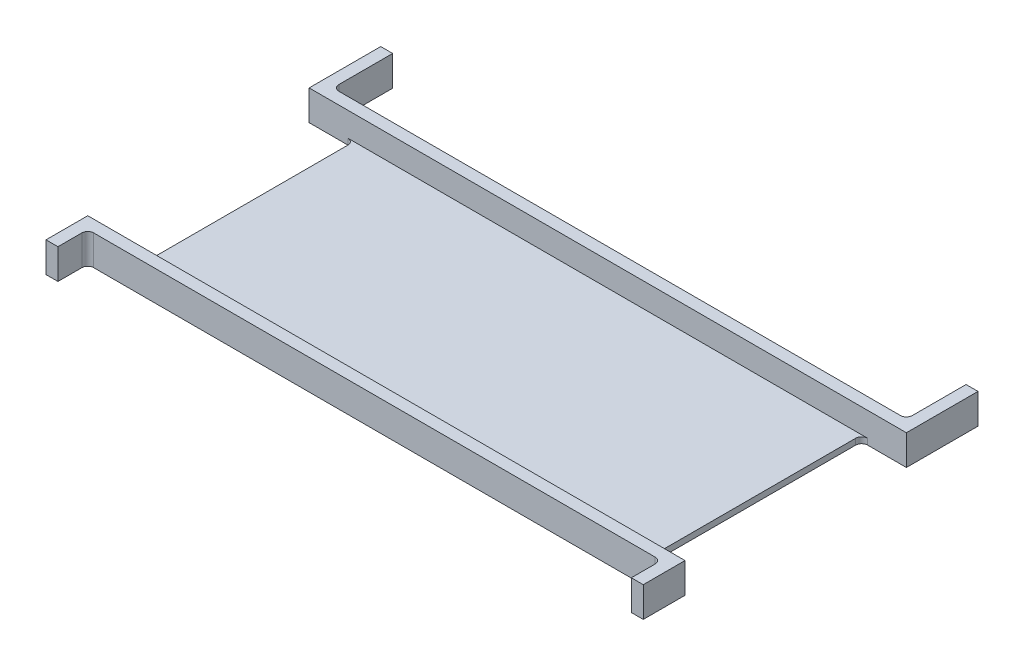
ISO-10303-21;
HEADER;
FILE_DESCRIPTION(('STEP AP214'),'2;1');
FILE_NAME('part.step','',(''),(''),'','','');
FILE_SCHEMA(('AUTOMOTIVE_DESIGN { 1 0 10303 214 1 1 1 1 }'));
ENDSEC;
DATA;
#1=APPLICATION_CONTEXT('core data for automotive mechanical design processes');
#2=APPLICATION_PROTOCOL_DEFINITION('international standard','automotive_design',2000,#1);
#3=PRODUCT_CONTEXT('',#1,'mechanical');
#4=PRODUCT('Part','Part','',(#3));
#5=PRODUCT_RELATED_PRODUCT_CATEGORY('part','',(#4));
#6=PRODUCT_DEFINITION_FORMATION('','',#4);
#7=PRODUCT_DEFINITION_CONTEXT('part definition',#1,'design');
#8=PRODUCT_DEFINITION('design','',#6,#7);
#9=PRODUCT_DEFINITION_SHAPE('','',#8);
#10=(LENGTH_UNIT() NAMED_UNIT(*) SI_UNIT(.MILLI.,.METRE.));
#11=(NAMED_UNIT(*) PLANE_ANGLE_UNIT() SI_UNIT($,.RADIAN.));
#12=(NAMED_UNIT(*) SI_UNIT($,.STERADIAN.) SOLID_ANGLE_UNIT());
#13=UNCERTAINTY_MEASURE_WITH_UNIT(LENGTH_MEASURE(1.E-05),#10,'distance_accuracy_value','');
#14=(GEOMETRIC_REPRESENTATION_CONTEXT(3) GLOBAL_UNCERTAINTY_ASSIGNED_CONTEXT((#13)) GLOBAL_UNIT_ASSIGNED_CONTEXT((#10,
#11,#12)) REPRESENTATION_CONTEXT('',''));
#15=CARTESIAN_POINT('',(0.,0.,0.));
#16=DIRECTION('',(0.,0.,1.));
#17=DIRECTION('',(1.,0.,0.));
#18=AXIS2_PLACEMENT_3D('',#15,#16,#17);
#19=CARTESIAN_POINT('',(92.6,1.,0.));
#20=DIRECTION('',(-1.,0.,0.));
#21=DIRECTION('',(0.,0.,1.));
#22=AXIS2_PLACEMENT_3D('',#19,#20,#21);
#23=PLANE('',#22);
#24=DIRECTION('',(0.,0.,-1.));
#25=VECTOR('',#24,1.);
#26=CARTESIAN_POINT('',(92.6,0.,0.));
#27=LINE('',#26,#25);
#28=CARTESIAN_POINT('',(92.6,0.,-8.00000000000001));
#29=VERTEX_POINT('',#28);
#30=CARTESIAN_POINT('',(92.6,0.,-43.1));
#31=VERTEX_POINT('',#30);
#32=EDGE_CURVE('E389',#29,#31,#27,.T.);
#33=ORIENTED_EDGE('',*,*,#32,.T.);
#34=DIRECTION('',(0.,-1.,0.));
#35=VECTOR('',#34,1.);
#36=CARTESIAN_POINT('',(92.6,1.,-43.1));
#37=LINE('',#36,#35);
#38=CARTESIAN_POINT('',(92.6,1.,-43.1));
#39=VERTEX_POINT('',#38);
#40=EDGE_CURVE('E11',#39,#31,#37,.T.);
#41=ORIENTED_EDGE('',*,*,#40,.F.);
#42=DIRECTION('',(0.,0.,-1.));
#43=VECTOR('',#42,1.);
#44=CARTESIAN_POINT('',(92.6,1.,0.));
#45=LINE('',#44,#43);
#46=CARTESIAN_POINT('',(92.6,1.,-8.00000000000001));
#47=VERTEX_POINT('',#46);
#48=EDGE_CURVE('E390',#47,#39,#45,.T.);
#49=ORIENTED_EDGE('',*,*,#48,.F.);
#50=DIRECTION('',(0.,-1.,0.));
#51=VECTOR('',#50,1.);
#52=CARTESIAN_POINT('',(92.6,1.,-8.00000000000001));
#53=LINE('',#52,#51);
#54=EDGE_CURVE('E53',#47,#29,#53,.T.);
#55=ORIENTED_EDGE('',*,*,#54,.T.);
#56=EDGE_LOOP('',(#33,#41,#49,#55));
#57=FACE_BOUND('',#56,.T.);
#58=ADVANCED_FACE('F37',(#57),#23,.F.);
#59=CARTESIAN_POINT('',(93.6,1.,-43.1));
#60=DIRECTION('',(0.,-1.,0.));
#61=DIRECTION('',(0.,0.,-1.));
#62=AXIS2_PLACEMENT_3D('',#59,#60,#61);
#63=CYLINDRICAL_SURFACE('',#62,1.);
#64=CARTESIAN_POINT('',(93.6,0.,-43.1));
#65=DIRECTION('',(0.,1.,0.));
#66=DIRECTION('',(0.,0.,1.));
#67=AXIS2_PLACEMENT_3D('',#64,#65,#66);
#68=CIRCLE('',#67,1.);
#69=CARTESIAN_POINT('',(93.6,0.,-44.1));
#70=VERTEX_POINT('',#69);
#71=EDGE_CURVE('E409',#31,#70,#68,.F.);
#72=ORIENTED_EDGE('',*,*,#71,.T.);
#73=DIRECTION('',(0.,-1.,0.));
#74=VECTOR('',#73,1.);
#75=CARTESIAN_POINT('',(93.6,1.,-44.1));
#76=LINE('',#75,#74);
#77=CARTESIAN_POINT('',(93.6,1.,-44.1));
#78=VERTEX_POINT('',#77);
#79=EDGE_CURVE('E45',#78,#70,#76,.T.);
#80=ORIENTED_EDGE('',*,*,#79,.F.);
#81=CARTESIAN_POINT('',(93.6,1.,-43.1));
#82=DIRECTION('',(0.,1.,0.));
#83=DIRECTION('',(0.,0.,1.));
#84=AXIS2_PLACEMENT_3D('',#81,#82,#83);
#85=CIRCLE('',#84,1.);
#86=EDGE_CURVE('E89',#39,#78,#85,.F.);
#87=ORIENTED_EDGE('',*,*,#86,.F.);
#88=ORIENTED_EDGE('',*,*,#40,.T.);
#89=EDGE_LOOP('',(#72,#80,#87,#88));
#90=FACE_BOUND('',#89,.T.);
#91=ADVANCED_FACE('F440',(#90),#63,.F.);
#92=CARTESIAN_POINT('',(6.5,1.,-43.1));
#93=DIRECTION('',(0.,-1.,0.));
#94=DIRECTION('',(0.,0.,-1.));
#95=AXIS2_PLACEMENT_3D('',#92,#93,#94);
#96=CYLINDRICAL_SURFACE('',#95,1.);
#97=CARTESIAN_POINT('',(6.5,0.,-43.1));
#98=DIRECTION('',(0.,1.,0.));
#99=DIRECTION('',(0.,0.,1.));
#100=AXIS2_PLACEMENT_3D('',#97,#98,#99);
#101=CIRCLE('',#100,1.);
#102=CARTESIAN_POINT('',(7.5,0.,-43.1));
#103=VERTEX_POINT('',#102);
#104=CARTESIAN_POINT('',(6.49999999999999,0.,-44.1));
#105=VERTEX_POINT('',#104);
#106=EDGE_CURVE('E412',#103,#105,#101,.T.);
#107=ORIENTED_EDGE('',*,*,#106,.F.);
#108=DIRECTION('',(0.,-1.,0.));
#109=VECTOR('',#108,1.);
#110=CARTESIAN_POINT('',(7.5,1.,-43.1));
#111=LINE('',#110,#109);
#112=CARTESIAN_POINT('',(7.5,1.,-43.1));
#113=VERTEX_POINT('',#112);
#114=EDGE_CURVE('E431',#113,#103,#111,.T.);
#115=ORIENTED_EDGE('',*,*,#114,.F.);
#116=CARTESIAN_POINT('',(6.5,1.,-43.1));
#117=DIRECTION('',(0.,1.,0.));
#118=DIRECTION('',(0.,0.,1.));
#119=AXIS2_PLACEMENT_3D('',#116,#117,#118);
#120=CIRCLE('',#119,1.);
#121=CARTESIAN_POINT('',(6.49999999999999,1.,-44.1));
#122=VERTEX_POINT('',#121);
#123=EDGE_CURVE('E396',#113,#122,#120,.T.);
#124=ORIENTED_EDGE('',*,*,#123,.T.);
#125=DIRECTION('',(0.,-1.,0.));
#126=VECTOR('',#125,1.);
#127=CARTESIAN_POINT('',(6.5,1.,-44.1));
#128=LINE('',#127,#126);
#129=EDGE_CURVE('E433',#122,#105,#128,.T.);
#130=ORIENTED_EDGE('',*,*,#129,.T.);
#131=EDGE_LOOP('',(#107,#115,#124,#130));
#132=FACE_BOUND('',#131,.T.);
#133=ADVANCED_FACE('F468',(#132),#96,.F.);
#134=CARTESIAN_POINT('',(7.5,1.,0.));
#135=DIRECTION('',(1.,0.,0.));
#136=DIRECTION('',(0.,0.,-1.));
#137=AXIS2_PLACEMENT_3D('',#134,#135,#136);
#138=PLANE('',#137);
#139=DIRECTION('',(0.,0.,1.));
#140=VECTOR('',#139,1.);
#141=CARTESIAN_POINT('',(7.5,0.,0.));
#142=LINE('',#141,#140);
#143=CARTESIAN_POINT('',(7.5,0.,-8.00000000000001));
#144=VERTEX_POINT('',#143);
#145=EDGE_CURVE('E415',#103,#144,#142,.T.);
#146=ORIENTED_EDGE('',*,*,#145,.T.);
#147=DIRECTION('',(0.,-1.,0.));
#148=VECTOR('',#147,1.);
#149=CARTESIAN_POINT('',(7.5,1.,-8.00000000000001));
#150=LINE('',#149,#148);
#151=CARTESIAN_POINT('',(7.5,1.,-8.00000000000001));
#152=VERTEX_POINT('',#151);
#153=EDGE_CURVE('E428',#152,#144,#150,.T.);
#154=ORIENTED_EDGE('',*,*,#153,.F.);
#155=DIRECTION('',(0.,0.,1.));
#156=VECTOR('',#155,1.);
#157=CARTESIAN_POINT('',(7.5,1.,0.));
#158=LINE('',#157,#156);
#159=EDGE_CURVE('E399',#113,#152,#158,.T.);
#160=ORIENTED_EDGE('',*,*,#159,.F.);
#161=ORIENTED_EDGE('',*,*,#114,.T.);
#162=EDGE_LOOP('',(#146,#154,#160,#161));
#163=FACE_BOUND('',#162,.T.);
#164=ADVANCED_FACE('F482',(#163),#138,.F.);
#165=CARTESIAN_POINT('',(6.5,1.,-8.));
#166=DIRECTION('',(0.,-1.,0.));
#167=DIRECTION('',(0.,0.,-1.));
#168=AXIS2_PLACEMENT_3D('',#165,#166,#167);
#169=CYLINDRICAL_SURFACE('',#168,1.);
#170=CARTESIAN_POINT('',(6.5,0.,-8.));
#171=DIRECTION('',(0.,1.,0.));
#172=DIRECTION('',(0.,0.,1.));
#173=AXIS2_PLACEMENT_3D('',#170,#171,#172);
#174=CIRCLE('',#173,1.);
#175=CARTESIAN_POINT('',(6.49999999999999,0.,-7.));
#176=VERTEX_POINT('',#175);
#177=EDGE_CURVE('E417',#144,#176,#174,.F.);
#178=ORIENTED_EDGE('',*,*,#177,.T.);
#179=DIRECTION('',(0.,-1.,0.));
#180=VECTOR('',#179,1.);
#181=CARTESIAN_POINT('',(6.49999999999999,1.,-7.));
#182=LINE('',#181,#180);
#183=CARTESIAN_POINT('',(6.49999999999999,1.,-7.));
#184=VERTEX_POINT('',#183);
#185=EDGE_CURVE('E426',#184,#176,#182,.T.);
#186=ORIENTED_EDGE('',*,*,#185,.F.);
#187=CARTESIAN_POINT('',(6.5,1.,-8.));
#188=DIRECTION('',(0.,1.,0.));
#189=DIRECTION('',(0.,0.,1.));
#190=AXIS2_PLACEMENT_3D('',#187,#188,#189);
#191=CIRCLE('',#190,1.);
#192=EDGE_CURVE('E401',#152,#184,#191,.F.);
#193=ORIENTED_EDGE('',*,*,#192,.F.);
#194=ORIENTED_EDGE('',*,*,#153,.T.);
#195=EDGE_LOOP('',(#178,#186,#193,#194));
#196=FACE_BOUND('',#195,.T.);
#197=ADVANCED_FACE('F487',(#196),#169,.F.);
#198=CARTESIAN_POINT('',(93.6,1.,-8.));
#199=DIRECTION('',(0.,-1.,0.));
#200=DIRECTION('',(0.,0.,-1.));
#201=AXIS2_PLACEMENT_3D('',#198,#199,#200);
#202=CYLINDRICAL_SURFACE('',#201,1.);
#203=CARTESIAN_POINT('',(93.6,0.,-8.));
#204=DIRECTION('',(0.,1.,0.));
#205=DIRECTION('',(0.,0.,1.));
#206=AXIS2_PLACEMENT_3D('',#203,#204,#205);
#207=CIRCLE('',#206,1.);
#208=CARTESIAN_POINT('',(93.6,0.,-7.));
#209=VERTEX_POINT('',#208);
#210=EDGE_CURVE('E392',#29,#209,#207,.T.);
#211=ORIENTED_EDGE('',*,*,#210,.F.);
#212=ORIENTED_EDGE('',*,*,#54,.F.);
#213=CARTESIAN_POINT('',(93.6,1.,-8.));
#214=DIRECTION('',(0.,1.,0.));
#215=DIRECTION('',(0.,0.,1.));
#216=AXIS2_PLACEMENT_3D('',#213,#214,#215);
#217=CIRCLE('',#216,1.);
#218=CARTESIAN_POINT('',(93.6,1.,-7.));
#219=VERTEX_POINT('',#218);
#220=EDGE_CURVE('E406',#47,#219,#217,.T.);
#221=ORIENTED_EDGE('',*,*,#220,.T.);
#222=DIRECTION('',(0.,-1.,0.));
#223=VECTOR('',#222,1.);
#224=CARTESIAN_POINT('',(93.6,1.,-7.));
#225=LINE('',#224,#223);
#226=EDGE_CURVE('E423',#219,#209,#225,.T.);
#227=ORIENTED_EDGE('',*,*,#226,.T.);
#228=EDGE_LOOP('',(#211,#212,#221,#227));
#229=FACE_BOUND('',#228,.T.);
#230=ADVANCED_FACE('F491',(#229),#202,.F.);
#231=CARTESIAN_POINT('',(0.,1.,0.));
#232=DIRECTION('',(0.,1.,0.));
#233=DIRECTION('',(0.,0.,1.));
#234=AXIS2_PLACEMENT_3D('',#231,#232,#233);
#235=PLANE('',#234);
#236=ORIENTED_EDGE('',*,*,#48,.T.);
#237=ORIENTED_EDGE('',*,*,#86,.T.);
#238=DIRECTION('',(1.,0.,0.));
#239=VECTOR('',#238,1.);
#240=CARTESIAN_POINT('',(0.,1.,-44.1));
#241=LINE('',#240,#239);
#242=EDGE_CURVE('E394',#122,#78,#241,.T.);
#243=ORIENTED_EDGE('',*,*,#242,.F.);
#244=ORIENTED_EDGE('',*,*,#123,.F.);
#245=ORIENTED_EDGE('',*,*,#159,.T.);
#246=ORIENTED_EDGE('',*,*,#192,.T.);
#247=DIRECTION('',(-1.,0.,0.));
#248=VECTOR('',#247,1.);
#249=CARTESIAN_POINT('',(0.,1.,-7.));
#250=LINE('',#249,#248);
#251=EDGE_CURVE('E404',#219,#184,#250,.T.);
#252=ORIENTED_EDGE('',*,*,#251,.F.);
#253=ORIENTED_EDGE('',*,*,#220,.F.);
#254=EDGE_LOOP('',(#236,#237,#243,#244,#245,#246,#252,#253));
#255=FACE_BOUND('',#254,.T.);
#256=ADVANCED_FACE('F472',(#255),#235,.T.);
#257=CARTESIAN_POINT('',(0.,0.,0.));
#258=DIRECTION('',(0.,1.,0.));
#259=DIRECTION('',(0.,0.,1.));
#260=AXIS2_PLACEMENT_3D('',#257,#258,#259);
#261=PLANE('',#260);
#262=ORIENTED_EDGE('',*,*,#32,.F.);
#263=ORIENTED_EDGE('',*,*,#210,.T.);
#264=DIRECTION('',(-1.,0.,0.));
#265=VECTOR('',#264,1.);
#266=CARTESIAN_POINT('',(0.,0.,-7.));
#267=LINE('',#266,#265);
#268=CARTESIAN_POINT('',(100.1,0.,-7.));
#269=VERTEX_POINT('',#268);
#270=EDGE_CURVE('E286',#269,#209,#267,.T.);
#271=ORIENTED_EDGE('',*,*,#270,.F.);
#272=DIRECTION('',(0.,0.,-1.));
#273=VECTOR('',#272,1.);
#274=CARTESIAN_POINT('',(100.1,0.,0.));
#275=LINE('',#274,#273);
#276=CARTESIAN_POINT('',(100.1,0.,0.));
#277=VERTEX_POINT('',#276);
#278=EDGE_CURVE('E284',#277,#269,#275,.T.);
#279=ORIENTED_EDGE('',*,*,#278,.F.);
#280=DIRECTION('',(1.,0.,0.));
#281=VECTOR('',#280,1.);
#282=CARTESIAN_POINT('',(0.,0.,0.));
#283=LINE('',#282,#281);
#284=CARTESIAN_POINT('',(98.1,0.,0.));
#285=VERTEX_POINT('',#284);
#286=EDGE_CURVE('E282',#285,#277,#283,.T.);
#287=ORIENTED_EDGE('',*,*,#286,.F.);
#288=DIRECTION('',(0.,0.,1.));
#289=VECTOR('',#288,1.);
#290=CARTESIAN_POINT('',(98.1,0.,0.));
#291=LINE('',#290,#289);
#292=CARTESIAN_POINT('',(98.1,0.,-3.99999999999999));
#293=VERTEX_POINT('',#292);
#294=EDGE_CURVE('E280',#293,#285,#291,.T.);
#295=ORIENTED_EDGE('',*,*,#294,.F.);
#296=CARTESIAN_POINT('',(97.1,0.,-4.));
#297=DIRECTION('',(0.,1.,0.));
#298=DIRECTION('',(0.,0.,1.));
#299=AXIS2_PLACEMENT_3D('',#296,#297,#298);
#300=CIRCLE('',#299,1.);
#301=CARTESIAN_POINT('',(97.1,0.,-5.));
#302=VERTEX_POINT('',#301);
#303=EDGE_CURVE('E237',#293,#302,#300,.T.);
#304=ORIENTED_EDGE('',*,*,#303,.T.);
#305=DIRECTION('',(1.,0.,0.));
#306=VECTOR('',#305,1.);
#307=CARTESIAN_POINT('',(0.,0.,-5.));
#308=LINE('',#307,#306);
#309=CARTESIAN_POINT('',(3.00000000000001,0.,-5.));
#310=VERTEX_POINT('',#309);
#311=EDGE_CURVE('E256',#310,#302,#308,.T.);
#312=ORIENTED_EDGE('',*,*,#311,.F.);
#313=CARTESIAN_POINT('',(3.,0.,-4.));
#314=DIRECTION('',(0.,1.,0.));
#315=DIRECTION('',(0.,0.,1.));
#316=AXIS2_PLACEMENT_3D('',#313,#314,#315);
#317=CIRCLE('',#316,1.);
#318=CARTESIAN_POINT('',(2.,0.,-3.99999999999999));
#319=VERTEX_POINT('',#318);
#320=EDGE_CURVE('E259',#310,#319,#317,.T.);
#321=ORIENTED_EDGE('',*,*,#320,.T.);
#322=DIRECTION('',(0.,0.,-1.));
#323=VECTOR('',#322,1.);
#324=CARTESIAN_POINT('',(2.,0.,0.));
#325=LINE('',#324,#323);
#326=CARTESIAN_POINT('',(2.,0.,0.));
#327=VERTEX_POINT('',#326);
#328=EDGE_CURVE('E292',#327,#319,#325,.T.);
#329=ORIENTED_EDGE('',*,*,#328,.F.);
#330=DIRECTION('',(1.,0.,0.));
#331=VECTOR('',#330,1.);
#332=CARTESIAN_POINT('',(0.,0.,0.));
#333=LINE('',#332,#331);
#334=CARTESIAN_POINT('',(0.,0.,0.));
#335=VERTEX_POINT('',#334);
#336=EDGE_CURVE('E290',#335,#327,#333,.T.);
#337=ORIENTED_EDGE('',*,*,#336,.F.);
#338=DIRECTION('',(0.,0.,-1.));
#339=VECTOR('',#338,1.);
#340=CARTESIAN_POINT('',(0.,0.,0.));
#341=LINE('',#340,#339);
#342=CARTESIAN_POINT('',(0.,0.,-7.));
#343=VERTEX_POINT('',#342);
#344=EDGE_CURVE('E288',#335,#343,#341,.T.);
#345=ORIENTED_EDGE('',*,*,#344,.T.);
#346=EDGE_CURVE('E78',#176,#343,#267,.T.);
#347=ORIENTED_EDGE('',*,*,#346,.F.);
#348=ORIENTED_EDGE('',*,*,#177,.F.);
#349=ORIENTED_EDGE('',*,*,#145,.F.);
#350=ORIENTED_EDGE('',*,*,#106,.T.);
#351=DIRECTION('',(1.,0.,0.));
#352=VECTOR('',#351,1.);
#353=CARTESIAN_POINT('',(0.,0.,-44.1));
#354=LINE('',#353,#352);
#355=CARTESIAN_POINT('',(0.,0.,-44.1));
#356=VERTEX_POINT('',#355);
#357=EDGE_CURVE('E351',#356,#105,#354,.T.);
#358=ORIENTED_EDGE('',*,*,#357,.F.);
#359=DIRECTION('',(0.,0.,1.));
#360=VECTOR('',#359,1.);
#361=CARTESIAN_POINT('',(0.,0.,0.));
#362=LINE('',#361,#360);
#363=CARTESIAN_POINT('',(0.,0.,-56.1));
#364=VERTEX_POINT('',#363);
#365=EDGE_CURVE('E348',#364,#356,#362,.T.);
#366=ORIENTED_EDGE('',*,*,#365,.F.);
#367=DIRECTION('',(-1.,0.,0.));
#368=VECTOR('',#367,1.);
#369=CARTESIAN_POINT('',(1.94635974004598E-13,0.,-56.1));
#370=LINE('',#369,#368);
#371=CARTESIAN_POINT('',(2.,0.,-56.1));
#372=VERTEX_POINT('',#371);
#373=EDGE_CURVE('E346',#372,#364,#370,.T.);
#374=ORIENTED_EDGE('',*,*,#373,.F.);
#375=DIRECTION('',(0.,0.,-1.));
#376=VECTOR('',#375,1.);
#377=CARTESIAN_POINT('',(2.,0.,0.));
#378=LINE('',#377,#376);
#379=CARTESIAN_POINT('',(2.,0.,-47.1));
#380=VERTEX_POINT('',#379);
#381=EDGE_CURVE('E344',#380,#372,#378,.T.);
#382=ORIENTED_EDGE('',*,*,#381,.F.);
#383=CARTESIAN_POINT('',(3.,0.,-47.1));
#384=DIRECTION('',(0.,1.,0.));
#385=DIRECTION('',(0.,0.,1.));
#386=AXIS2_PLACEMENT_3D('',#383,#384,#385);
#387=CIRCLE('',#386,1.);
#388=CARTESIAN_POINT('',(3.00000000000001,0.,-46.1));
#389=VERTEX_POINT('',#388);
#390=EDGE_CURVE('E342',#389,#380,#387,.F.);
#391=ORIENTED_EDGE('',*,*,#390,.F.);
#392=DIRECTION('',(-1.,0.,0.));
#393=VECTOR('',#392,1.);
#394=CARTESIAN_POINT('',(0.,0.,-46.1));
#395=LINE('',#394,#393);
#396=CARTESIAN_POINT('',(97.1,0.,-46.1));
#397=VERTEX_POINT('',#396);
#398=EDGE_CURVE('E240',#397,#389,#395,.T.);
#399=ORIENTED_EDGE('',*,*,#398,.F.);
#400=CARTESIAN_POINT('',(97.1,0.,-47.1));
#401=DIRECTION('',(0.,1.,0.));
#402=DIRECTION('',(0.,0.,1.));
#403=AXIS2_PLACEMENT_3D('',#400,#401,#402);
#404=CIRCLE('',#403,1.);
#405=CARTESIAN_POINT('',(98.1,0.,-47.1));
#406=VERTEX_POINT('',#405);
#407=EDGE_CURVE('E321',#406,#397,#404,.F.);
#408=ORIENTED_EDGE('',*,*,#407,.F.);
#409=DIRECTION('',(0.,0.,1.));
#410=VECTOR('',#409,1.);
#411=CARTESIAN_POINT('',(98.1000000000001,0.,-1.51267887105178E-13));
#412=LINE('',#411,#410);
#413=CARTESIAN_POINT('',(98.1,0.,-56.1));
#414=VERTEX_POINT('',#413);
#415=EDGE_CURVE('E357',#414,#406,#412,.T.);
#416=ORIENTED_EDGE('',*,*,#415,.F.);
#417=DIRECTION('',(-1.,0.,0.));
#418=VECTOR('',#417,1.);
#419=CARTESIAN_POINT('',(0.,0.,-56.1));
#420=LINE('',#419,#418);
#421=CARTESIAN_POINT('',(100.1,0.,-56.1));
#422=VERTEX_POINT('',#421);
#423=EDGE_CURVE('E355',#422,#414,#420,.T.);
#424=ORIENTED_EDGE('',*,*,#423,.F.);
#425=DIRECTION('',(0.,0.,-1.));
#426=VECTOR('',#425,1.);
#427=CARTESIAN_POINT('',(100.1,0.,0.));
#428=LINE('',#427,#426);
#429=CARTESIAN_POINT('',(100.1,0.,-44.1));
#430=VERTEX_POINT('',#429);
#431=EDGE_CURVE('E353',#430,#422,#428,.T.);
#432=ORIENTED_EDGE('',*,*,#431,.F.);
#433=EDGE_CURVE('E350',#70,#430,#354,.T.);
#434=ORIENTED_EDGE('',*,*,#433,.F.);
#435=ORIENTED_EDGE('',*,*,#71,.F.);
#436=EDGE_LOOP('',(#262,#263,#271,#279,#287,#295,#304,#312,#321,#329,#337,#345,#347,#348,#349,
#350,#358,#366,#374,#382,#391,#399,#408,#416,#424,#432,#434,#435));
#437=FACE_BOUND('',#436,.T.);
#438=ADVANCED_FACE('F442',(#437),#261,.F.);
#439=CARTESIAN_POINT('',(0.,5.05,-46.1));
#440=DIRECTION('',(0.,0.,1.));
#441=DIRECTION('',(1.,0.,0.));
#442=AXIS2_PLACEMENT_3D('',#439,#440,#441);
#443=PLANE('',#442);
#444=ORIENTED_EDGE('',*,*,#398,.T.);
#445=DIRECTION('',(0.,-1.,0.));
#446=VECTOR('',#445,1.);
#447=CARTESIAN_POINT('',(3.00000000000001,5.05,-46.1));
#448=LINE('',#447,#446);
#449=CARTESIAN_POINT('',(3.00000000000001,5.05,-46.1));
#450=VERTEX_POINT('',#449);
#451=EDGE_CURVE('E386',#450,#389,#448,.T.);
#452=ORIENTED_EDGE('',*,*,#451,.F.);
#453=DIRECTION('',(-1.,0.,0.));
#454=VECTOR('',#453,1.);
#455=CARTESIAN_POINT('',(0.,5.05,-46.1));
#456=LINE('',#455,#454);
#457=CARTESIAN_POINT('',(97.1,5.05,-46.1));
#458=VERTEX_POINT('',#457);
#459=EDGE_CURVE('E317',#458,#450,#456,.T.);
#460=ORIENTED_EDGE('',*,*,#459,.F.);
#461=DIRECTION('',(0.,-1.,0.));
#462=VECTOR('',#461,1.);
#463=CARTESIAN_POINT('',(97.1,5.05,-46.1));
#464=LINE('',#463,#462);
#465=EDGE_CURVE('E339',#458,#397,#464,.T.);
#466=ORIENTED_EDGE('',*,*,#465,.T.);
#467=EDGE_LOOP('',(#444,#452,#460,#466));
#468=FACE_BOUND('',#467,.T.);
#469=ADVANCED_FACE('F497',(#468),#443,.F.);
#470=CARTESIAN_POINT('',(3.,5.05,-47.1));
#471=DIRECTION('',(0.,-1.,0.));
#472=DIRECTION('',(0.,0.,-1.));
#473=AXIS2_PLACEMENT_3D('',#470,#471,#472);
#474=CYLINDRICAL_SURFACE('',#473,1.);
#475=ORIENTED_EDGE('',*,*,#390,.T.);
#476=DIRECTION('',(0.,-1.,0.));
#477=VECTOR('',#476,1.);
#478=CARTESIAN_POINT('',(2.,5.05,-47.1));
#479=LINE('',#478,#477);
#480=CARTESIAN_POINT('',(2.,5.05,-47.1));
#481=VERTEX_POINT('',#480);
#482=EDGE_CURVE('E383',#481,#380,#479,.T.);
#483=ORIENTED_EDGE('',*,*,#482,.F.);
#484=CARTESIAN_POINT('',(3.,5.05,-47.1));
#485=DIRECTION('',(0.,1.,0.));
#486=DIRECTION('',(0.,0.,1.));
#487=AXIS2_PLACEMENT_3D('',#484,#485,#486);
#488=CIRCLE('',#487,1.);
#489=EDGE_CURVE('E320',#450,#481,#488,.F.);
#490=ORIENTED_EDGE('',*,*,#489,.F.);
#491=ORIENTED_EDGE('',*,*,#451,.T.);
#492=EDGE_LOOP('',(#475,#483,#490,#491));
#493=FACE_BOUND('',#492,.T.);
#494=ADVANCED_FACE('F502',(#493),#474,.F.);
#495=CARTESIAN_POINT('',(2.,5.05,0.));
#496=DIRECTION('',(-1.,0.,0.));
#497=DIRECTION('',(0.,0.,1.));
#498=AXIS2_PLACEMENT_3D('',#495,#496,#497);
#499=PLANE('',#498);
#500=ORIENTED_EDGE('',*,*,#381,.T.);
#501=DIRECTION('',(0.,-1.,0.));
#502=VECTOR('',#501,1.);
#503=CARTESIAN_POINT('',(2.,5.05,-56.1));
#504=LINE('',#503,#502);
#505=CARTESIAN_POINT('',(2.,5.05,-56.1));
#506=VERTEX_POINT('',#505);
#507=EDGE_CURVE('E380',#506,#372,#504,.T.);
#508=ORIENTED_EDGE('',*,*,#507,.F.);
#509=DIRECTION('',(0.,0.,-1.));
#510=VECTOR('',#509,1.);
#511=CARTESIAN_POINT('',(2.,5.05,0.));
#512=LINE('',#511,#510);
#513=EDGE_CURVE('E323',#481,#506,#512,.T.);
#514=ORIENTED_EDGE('',*,*,#513,.F.);
#515=ORIENTED_EDGE('',*,*,#482,.T.);
#516=EDGE_LOOP('',(#500,#508,#514,#515));
#517=FACE_BOUND('',#516,.T.);
#518=ADVANCED_FACE('F506',(#517),#499,.F.);
#519=CARTESIAN_POINT('',(1.94635974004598E-13,5.05,-56.1));
#520=DIRECTION('',(0.,0.,1.));
#521=DIRECTION('',(1.,0.,0.));
#522=AXIS2_PLACEMENT_3D('',#519,#520,#521);
#523=PLANE('',#522);
#524=ORIENTED_EDGE('',*,*,#373,.T.);
#525=DIRECTION('',(0.,-1.,0.));
#526=VECTOR('',#525,1.);
#527=CARTESIAN_POINT('',(0.,5.05,-56.1));
#528=LINE('',#527,#526);
#529=CARTESIAN_POINT('',(0.,5.05,-56.1));
#530=VERTEX_POINT('',#529);
#531=EDGE_CURVE('E377',#530,#364,#528,.T.);
#532=ORIENTED_EDGE('',*,*,#531,.F.);
#533=DIRECTION('',(-1.,0.,0.));
#534=VECTOR('',#533,1.);
#535=CARTESIAN_POINT('',(1.94635974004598E-13,5.05,-56.1));
#536=LINE('',#535,#534);
#537=EDGE_CURVE('E325',#506,#530,#536,.T.);
#538=ORIENTED_EDGE('',*,*,#537,.F.);
#539=ORIENTED_EDGE('',*,*,#507,.T.);
#540=EDGE_LOOP('',(#524,#532,#538,#539));
#541=FACE_BOUND('',#540,.T.);
#542=ADVANCED_FACE('F510',(#541),#523,.F.);
#543=CARTESIAN_POINT('',(0.,5.05,0.));
#544=DIRECTION('',(1.,0.,0.));
#545=DIRECTION('',(0.,0.,-1.));
#546=AXIS2_PLACEMENT_3D('',#543,#544,#545);
#547=PLANE('',#546);
#548=ORIENTED_EDGE('',*,*,#365,.T.);
#549=DIRECTION('',(0.,-1.,0.));
#550=VECTOR('',#549,1.);
#551=CARTESIAN_POINT('',(0.,5.05,-44.1));
#552=LINE('',#551,#550);
#553=CARTESIAN_POINT('',(0.,5.05,-44.1));
#554=VERTEX_POINT('',#553);
#555=EDGE_CURVE('E374',#554,#356,#552,.T.);
#556=ORIENTED_EDGE('',*,*,#555,.F.);
#557=DIRECTION('',(0.,0.,1.));
#558=VECTOR('',#557,1.);
#559=CARTESIAN_POINT('',(0.,5.05,0.));
#560=LINE('',#559,#558);
#561=EDGE_CURVE('E327',#530,#554,#560,.T.);
#562=ORIENTED_EDGE('',*,*,#561,.F.);
#563=ORIENTED_EDGE('',*,*,#531,.T.);
#564=EDGE_LOOP('',(#548,#556,#562,#563));
#565=FACE_BOUND('',#564,.T.);
#566=ADVANCED_FACE('F514',(#565),#547,.F.);
#567=CARTESIAN_POINT('',(0.,5.05,-44.1));
#568=DIRECTION('',(0.,0.,-1.));
#569=DIRECTION('',(-1.,0.,0.));
#570=AXIS2_PLACEMENT_3D('',#567,#568,#569);
#571=PLANE('',#570);
#572=ORIENTED_EDGE('',*,*,#79,.T.);
#573=ORIENTED_EDGE('',*,*,#433,.T.);
#574=DIRECTION('',(0.,-1.,0.));
#575=VECTOR('',#574,1.);
#576=CARTESIAN_POINT('',(100.1,5.05,-44.1));
#577=LINE('',#576,#575);
#578=CARTESIAN_POINT('',(100.1,5.05,-44.1));
#579=VERTEX_POINT('',#578);
#580=EDGE_CURVE('E371',#579,#430,#577,.T.);
#581=ORIENTED_EDGE('',*,*,#580,.F.);
#582=DIRECTION('',(1.,0.,0.));
#583=VECTOR('',#582,1.);
#584=CARTESIAN_POINT('',(0.,5.05,-44.1));
#585=LINE('',#584,#583);
#586=EDGE_CURVE('E329',#554,#579,#585,.T.);
#587=ORIENTED_EDGE('',*,*,#586,.F.);
#588=ORIENTED_EDGE('',*,*,#555,.T.);
#589=ORIENTED_EDGE('',*,*,#357,.T.);
#590=ORIENTED_EDGE('',*,*,#129,.F.);
#591=ORIENTED_EDGE('',*,*,#242,.T.);
#592=EDGE_LOOP('',(#572,#573,#581,#587,#588,#589,#590,#591));
#593=FACE_BOUND('',#592,.T.);
#594=ADVANCED_FACE('F437',(#593),#571,.F.);
#595=CARTESIAN_POINT('',(100.1,5.05,0.));
#596=DIRECTION('',(-1.,0.,0.));
#597=DIRECTION('',(0.,0.,1.));
#598=AXIS2_PLACEMENT_3D('',#595,#596,#597);
#599=PLANE('',#598);
#600=ORIENTED_EDGE('',*,*,#431,.T.);
#601=DIRECTION('',(0.,-1.,0.));
#602=VECTOR('',#601,1.);
#603=CARTESIAN_POINT('',(100.1,5.05,-56.1));
#604=LINE('',#603,#602);
#605=CARTESIAN_POINT('',(100.1,5.05,-56.1));
#606=VERTEX_POINT('',#605);
#607=EDGE_CURVE('E368',#606,#422,#604,.T.);
#608=ORIENTED_EDGE('',*,*,#607,.F.);
#609=DIRECTION('',(0.,0.,-1.));
#610=VECTOR('',#609,1.);
#611=CARTESIAN_POINT('',(100.1,5.05,0.));
#612=LINE('',#611,#610);
#613=EDGE_CURVE('E331',#579,#606,#612,.T.);
#614=ORIENTED_EDGE('',*,*,#613,.F.);
#615=ORIENTED_EDGE('',*,*,#580,.T.);
#616=EDGE_LOOP('',(#600,#608,#614,#615));
#617=FACE_BOUND('',#616,.T.);
#618=ADVANCED_FACE('F448',(#617),#599,.F.);
#619=CARTESIAN_POINT('',(0.,5.05,-56.1));
#620=DIRECTION('',(0.,0.,1.));
#621=DIRECTION('',(1.,0.,0.));
#622=AXIS2_PLACEMENT_3D('',#619,#620,#621);
#623=PLANE('',#622);
#624=ORIENTED_EDGE('',*,*,#423,.T.);
#625=DIRECTION('',(0.,-1.,0.));
#626=VECTOR('',#625,1.);
#627=CARTESIAN_POINT('',(98.1,5.05,-56.1));
#628=LINE('',#627,#626);
#629=CARTESIAN_POINT('',(98.1,5.05,-56.1));
#630=VERTEX_POINT('',#629);
#631=EDGE_CURVE('E365',#630,#414,#628,.T.);
#632=ORIENTED_EDGE('',*,*,#631,.F.);
#633=DIRECTION('',(-1.,0.,0.));
#634=VECTOR('',#633,1.);
#635=CARTESIAN_POINT('',(0.,5.05,-56.1));
#636=LINE('',#635,#634);
#637=EDGE_CURVE('E333',#606,#630,#636,.T.);
#638=ORIENTED_EDGE('',*,*,#637,.F.);
#639=ORIENTED_EDGE('',*,*,#607,.T.);
#640=EDGE_LOOP('',(#624,#632,#638,#639));
#641=FACE_BOUND('',#640,.T.);
#642=ADVANCED_FACE('F452',(#641),#623,.F.);
#643=CARTESIAN_POINT('',(98.1000000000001,5.05,-1.51267887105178E-13));
#644=DIRECTION('',(1.,0.,0.));
#645=DIRECTION('',(0.,0.,-1.));
#646=AXIS2_PLACEMENT_3D('',#643,#644,#645);
#647=PLANE('',#646);
#648=ORIENTED_EDGE('',*,*,#415,.T.);
#649=DIRECTION('',(0.,-1.,0.));
#650=VECTOR('',#649,1.);
#651=CARTESIAN_POINT('',(98.1,5.05,-47.1));
#652=LINE('',#651,#650);
#653=CARTESIAN_POINT('',(98.1,5.05,-47.1));
#654=VERTEX_POINT('',#653);
#655=EDGE_CURVE('E362',#654,#406,#652,.T.);
#656=ORIENTED_EDGE('',*,*,#655,.F.);
#657=DIRECTION('',(0.,0.,1.));
#658=VECTOR('',#657,1.);
#659=CARTESIAN_POINT('',(98.1000000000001,5.05,-1.51267887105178E-13));
#660=LINE('',#659,#658);
#661=EDGE_CURVE('E335',#630,#654,#660,.T.);
#662=ORIENTED_EDGE('',*,*,#661,.F.);
#663=ORIENTED_EDGE('',*,*,#631,.T.);
#664=EDGE_LOOP('',(#648,#656,#662,#663));
#665=FACE_BOUND('',#664,.T.);
#666=ADVANCED_FACE('F524',(#665),#647,.F.);
#667=CARTESIAN_POINT('',(97.1,5.05,-47.1));
#668=DIRECTION('',(0.,-1.,0.));
#669=DIRECTION('',(0.,0.,-1.));
#670=AXIS2_PLACEMENT_3D('',#667,#668,#669);
#671=CYLINDRICAL_SURFACE('',#670,1.);
#672=ORIENTED_EDGE('',*,*,#407,.T.);
#673=ORIENTED_EDGE('',*,*,#465,.F.);
#674=CARTESIAN_POINT('',(97.1,5.05,-47.1));
#675=DIRECTION('',(0.,1.,0.));
#676=DIRECTION('',(0.,0.,1.));
#677=AXIS2_PLACEMENT_3D('',#674,#675,#676);
#678=CIRCLE('',#677,1.);
#679=EDGE_CURVE('E337',#654,#458,#678,.F.);
#680=ORIENTED_EDGE('',*,*,#679,.F.);
#681=ORIENTED_EDGE('',*,*,#655,.T.);
#682=EDGE_LOOP('',(#672,#673,#680,#681));
#683=FACE_BOUND('',#682,.T.);
#684=ADVANCED_FACE('F527',(#683),#671,.F.);
#685=CARTESIAN_POINT('',(0.,5.05,0.));
#686=DIRECTION('',(0.,1.,0.));
#687=DIRECTION('',(0.,0.,1.));
#688=AXIS2_PLACEMENT_3D('',#685,#686,#687);
#689=PLANE('',#688);
#690=ORIENTED_EDGE('',*,*,#459,.T.);
#691=ORIENTED_EDGE('',*,*,#489,.T.);
#692=ORIENTED_EDGE('',*,*,#513,.T.);
#693=ORIENTED_EDGE('',*,*,#537,.T.);
#694=ORIENTED_EDGE('',*,*,#561,.T.);
#695=ORIENTED_EDGE('',*,*,#586,.T.);
#696=ORIENTED_EDGE('',*,*,#613,.T.);
#697=ORIENTED_EDGE('',*,*,#637,.T.);
#698=ORIENTED_EDGE('',*,*,#661,.T.);
#699=ORIENTED_EDGE('',*,*,#679,.T.);
#700=EDGE_LOOP('',(#690,#691,#692,#693,#694,#695,#696,#697,#698,#699));
#701=FACE_BOUND('',#700,.T.);
#702=ADVANCED_FACE('F456',(#701),#689,.T.);
#703=CARTESIAN_POINT('',(97.1,5.05,-4.));
#704=DIRECTION('',(0.,-1.,0.));
#705=DIRECTION('',(0.,0.,-1.));
#706=AXIS2_PLACEMENT_3D('',#703,#704,#705);
#707=CYLINDRICAL_SURFACE('',#706,1.);
#708=ORIENTED_EDGE('',*,*,#303,.F.);
#709=DIRECTION('',(0.,-1.,0.));
#710=VECTOR('',#709,1.);
#711=CARTESIAN_POINT('',(98.1,5.05,-3.99999999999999));
#712=LINE('',#711,#710);
#713=CARTESIAN_POINT('',(98.1,5.05,-3.99999999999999));
#714=VERTEX_POINT('',#713);
#715=EDGE_CURVE('E231',#714,#293,#712,.T.);
#716=ORIENTED_EDGE('',*,*,#715,.F.);
#717=CARTESIAN_POINT('',(97.1,5.05,-4.));
#718=DIRECTION('',(0.,1.,0.));
#719=DIRECTION('',(0.,0.,1.));
#720=AXIS2_PLACEMENT_3D('',#717,#718,#719);
#721=CIRCLE('',#720,1.);
#722=CARTESIAN_POINT('',(97.1,5.05,-5.));
#723=VERTEX_POINT('',#722);
#724=EDGE_CURVE('E235',#714,#723,#721,.T.);
#725=ORIENTED_EDGE('',*,*,#724,.T.);
#726=DIRECTION('',(0.,-1.,0.));
#727=VECTOR('',#726,1.);
#728=CARTESIAN_POINT('',(97.1,5.05,-5.));
#729=LINE('',#728,#727);
#730=EDGE_CURVE('E278',#723,#302,#729,.T.);
#731=ORIENTED_EDGE('',*,*,#730,.T.);
#732=EDGE_LOOP('',(#708,#716,#725,#731));
#733=FACE_BOUND('',#732,.T.);
#734=ADVANCED_FACE('F233',(#733),#707,.F.);
#735=CARTESIAN_POINT('',(98.1,5.05,0.));
#736=DIRECTION('',(1.,0.,0.));
#737=DIRECTION('',(0.,0.,-1.));
#738=AXIS2_PLACEMENT_3D('',#735,#736,#737);
#739=PLANE('',#738);
#740=ORIENTED_EDGE('',*,*,#294,.T.);
#741=DIRECTION('',(0.,-1.,0.));
#742=VECTOR('',#741,1.);
#743=CARTESIAN_POINT('',(98.1,5.05,0.));
#744=LINE('',#743,#742);
#745=CARTESIAN_POINT('',(98.1,5.05,0.));
#746=VERTEX_POINT('',#745);
#747=EDGE_CURVE('E241',#746,#285,#744,.T.);
#748=ORIENTED_EDGE('',*,*,#747,.F.);
#749=DIRECTION('',(0.,0.,1.));
#750=VECTOR('',#749,1.);
#751=CARTESIAN_POINT('',(98.1,5.05,0.));
#752=LINE('',#751,#750);
#753=EDGE_CURVE('E244',#714,#746,#752,.T.);
#754=ORIENTED_EDGE('',*,*,#753,.F.);
#755=ORIENTED_EDGE('',*,*,#715,.T.);
#756=EDGE_LOOP('',(#740,#748,#754,#755));
#757=FACE_BOUND('',#756,.T.);
#758=ADVANCED_FACE('F245',(#757),#739,.F.);
#759=CARTESIAN_POINT('',(0.,5.05,0.));
#760=DIRECTION('',(0.,0.,-1.));
#761=DIRECTION('',(-1.,0.,0.));
#762=AXIS2_PLACEMENT_3D('',#759,#760,#761);
#763=PLANE('',#762);
#764=ORIENTED_EDGE('',*,*,#286,.T.);
#765=DIRECTION('',(0.,-1.,0.));
#766=VECTOR('',#765,1.);
#767=CARTESIAN_POINT('',(100.1,5.05,0.));
#768=LINE('',#767,#766);
#769=CARTESIAN_POINT('',(100.1,5.05,0.));
#770=VERTEX_POINT('',#769);
#771=EDGE_CURVE('E313',#770,#277,#768,.T.);
#772=ORIENTED_EDGE('',*,*,#771,.F.);
#773=DIRECTION('',(1.,0.,0.));
#774=VECTOR('',#773,1.);
#775=CARTESIAN_POINT('',(0.,5.05,0.));
#776=LINE('',#775,#774);
#777=EDGE_CURVE('E249',#746,#770,#776,.T.);
#778=ORIENTED_EDGE('',*,*,#777,.F.);
#779=ORIENTED_EDGE('',*,*,#747,.T.);
#780=EDGE_LOOP('',(#764,#772,#778,#779));
#781=FACE_BOUND('',#780,.T.);
#782=ADVANCED_FACE('F538',(#781),#763,.F.);
#783=CARTESIAN_POINT('',(100.1,5.05,0.));
#784=DIRECTION('',(-1.,0.,0.));
#785=DIRECTION('',(0.,0.,1.));
#786=AXIS2_PLACEMENT_3D('',#783,#784,#785);
#787=PLANE('',#786);
#788=ORIENTED_EDGE('',*,*,#278,.T.);
#789=DIRECTION('',(0.,-1.,0.));
#790=VECTOR('',#789,1.);
#791=CARTESIAN_POINT('',(100.1,5.05,-7.));
#792=LINE('',#791,#790);
#793=CARTESIAN_POINT('',(100.1,5.05,-7.));
#794=VERTEX_POINT('',#793);
#795=EDGE_CURVE('E310',#794,#269,#792,.T.);
#796=ORIENTED_EDGE('',*,*,#795,.F.);
#797=DIRECTION('',(0.,0.,-1.));
#798=VECTOR('',#797,1.);
#799=CARTESIAN_POINT('',(100.1,5.05,0.));
#800=LINE('',#799,#798);
#801=EDGE_CURVE('E263',#770,#794,#800,.T.);
#802=ORIENTED_EDGE('',*,*,#801,.F.);
#803=ORIENTED_EDGE('',*,*,#771,.T.);
#804=EDGE_LOOP('',(#788,#796,#802,#803));
#805=FACE_BOUND('',#804,.T.);
#806=ADVANCED_FACE('F541',(#805),#787,.F.);
#807=CARTESIAN_POINT('',(0.,5.05,-7.));
#808=DIRECTION('',(0.,0.,1.));
#809=DIRECTION('',(1.,0.,0.));
#810=AXIS2_PLACEMENT_3D('',#807,#808,#809);
#811=PLANE('',#810);
#812=ORIENTED_EDGE('',*,*,#185,.T.);
#813=ORIENTED_EDGE('',*,*,#346,.T.);
#814=DIRECTION('',(0.,-1.,0.));
#815=VECTOR('',#814,1.);
#816=CARTESIAN_POINT('',(0.,5.05,-7.));
#817=LINE('',#816,#815);
#818=CARTESIAN_POINT('',(0.,5.05,-7.));
#819=VERTEX_POINT('',#818);
#820=EDGE_CURVE('E307',#819,#343,#817,.T.);
#821=ORIENTED_EDGE('',*,*,#820,.F.);
#822=DIRECTION('',(-1.,0.,0.));
#823=VECTOR('',#822,1.);
#824=CARTESIAN_POINT('',(0.,5.05,-7.));
#825=LINE('',#824,#823);
#826=EDGE_CURVE('E265',#794,#819,#825,.T.);
#827=ORIENTED_EDGE('',*,*,#826,.F.);
#828=ORIENTED_EDGE('',*,*,#795,.T.);
#829=ORIENTED_EDGE('',*,*,#270,.T.);
#830=ORIENTED_EDGE('',*,*,#226,.F.);
#831=ORIENTED_EDGE('',*,*,#251,.T.);
#832=EDGE_LOOP('',(#812,#813,#821,#827,#828,#829,#830,#831));
#833=FACE_BOUND('',#832,.T.);
#834=ADVANCED_FACE('F545',(#833),#811,.F.);
#835=CARTESIAN_POINT('',(0.,5.05,0.));
#836=DIRECTION('',(-1.,0.,0.));
#837=DIRECTION('',(0.,0.,1.));
#838=AXIS2_PLACEMENT_3D('',#835,#836,#837);
#839=PLANE('',#838);
#840=ORIENTED_EDGE('',*,*,#344,.F.);
#841=DIRECTION('',(0.,-1.,0.));
#842=VECTOR('',#841,1.);
#843=CARTESIAN_POINT('',(0.,5.05,0.));
#844=LINE('',#843,#842);
#845=CARTESIAN_POINT('',(0.,5.05,0.));
#846=VERTEX_POINT('',#845);
#847=EDGE_CURVE('E305',#846,#335,#844,.T.);
#848=ORIENTED_EDGE('',*,*,#847,.F.);
#849=DIRECTION('',(0.,0.,-1.));
#850=VECTOR('',#849,1.);
#851=CARTESIAN_POINT('',(0.,5.05,0.));
#852=LINE('',#851,#850);
#853=EDGE_CURVE('E267',#846,#819,#852,.T.);
#854=ORIENTED_EDGE('',*,*,#853,.T.);
#855=ORIENTED_EDGE('',*,*,#820,.T.);
#856=EDGE_LOOP('',(#840,#848,#854,#855));
#857=FACE_BOUND('',#856,.T.);
#858=ADVANCED_FACE('F549',(#857),#839,.T.);
#859=CARTESIAN_POINT('',(0.,5.05,0.));
#860=DIRECTION('',(0.,0.,-1.));
#861=DIRECTION('',(-1.,0.,0.));
#862=AXIS2_PLACEMENT_3D('',#859,#860,#861);
#863=PLANE('',#862);
#864=ORIENTED_EDGE('',*,*,#336,.T.);
#865=DIRECTION('',(0.,-1.,0.));
#866=VECTOR('',#865,1.);
#867=CARTESIAN_POINT('',(2.,5.05,0.));
#868=LINE('',#867,#866);
#869=CARTESIAN_POINT('',(2.,5.05,0.));
#870=VERTEX_POINT('',#869);
#871=EDGE_CURVE('E302',#870,#327,#868,.T.);
#872=ORIENTED_EDGE('',*,*,#871,.F.);
#873=DIRECTION('',(1.,0.,0.));
#874=VECTOR('',#873,1.);
#875=CARTESIAN_POINT('',(0.,5.05,0.));
#876=LINE('',#875,#874);
#877=EDGE_CURVE('E270',#846,#870,#876,.T.);
#878=ORIENTED_EDGE('',*,*,#877,.F.);
#879=ORIENTED_EDGE('',*,*,#847,.T.);
#880=EDGE_LOOP('',(#864,#872,#878,#879));
#881=FACE_BOUND('',#880,.T.);
#882=ADVANCED_FACE('F553',(#881),#863,.F.);
#883=CARTESIAN_POINT('',(2.,5.05,0.));
#884=DIRECTION('',(-1.,0.,0.));
#885=DIRECTION('',(0.,0.,1.));
#886=AXIS2_PLACEMENT_3D('',#883,#884,#885);
#887=PLANE('',#886);
#888=ORIENTED_EDGE('',*,*,#328,.T.);
#889=DIRECTION('',(0.,-1.,0.));
#890=VECTOR('',#889,1.);
#891=CARTESIAN_POINT('',(2.,5.05,-3.99999999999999));
#892=LINE('',#891,#890);
#893=CARTESIAN_POINT('',(2.,5.05,-3.99999999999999));
#894=VERTEX_POINT('',#893);
#895=EDGE_CURVE('E300',#894,#319,#892,.T.);
#896=ORIENTED_EDGE('',*,*,#895,.F.);
#897=DIRECTION('',(0.,0.,-1.));
#898=VECTOR('',#897,1.);
#899=CARTESIAN_POINT('',(2.,5.05,0.));
#900=LINE('',#899,#898);
#901=EDGE_CURVE('E272',#870,#894,#900,.T.);
#902=ORIENTED_EDGE('',*,*,#901,.F.);
#903=ORIENTED_EDGE('',*,*,#871,.T.);
#904=EDGE_LOOP('',(#888,#896,#902,#903));
#905=FACE_BOUND('',#904,.T.);
#906=ADVANCED_FACE('F557',(#905),#887,.F.);
#907=CARTESIAN_POINT('',(3.,5.05,-4.));
#908=DIRECTION('',(0.,-1.,0.));
#909=DIRECTION('',(0.,0.,-1.));
#910=AXIS2_PLACEMENT_3D('',#907,#908,#909);
#911=CYLINDRICAL_SURFACE('',#910,1.);
#912=ORIENTED_EDGE('',*,*,#320,.F.);
#913=DIRECTION('',(0.,-1.,0.));
#914=VECTOR('',#913,1.);
#915=CARTESIAN_POINT('',(3.00000000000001,5.05,-5.));
#916=LINE('',#915,#914);
#917=CARTESIAN_POINT('',(3.00000000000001,5.05,-5.));
#918=VERTEX_POINT('',#917);
#919=EDGE_CURVE('E298',#918,#310,#916,.T.);
#920=ORIENTED_EDGE('',*,*,#919,.F.);
#921=CARTESIAN_POINT('',(3.,5.05,-4.));
#922=DIRECTION('',(0.,1.,0.));
#923=DIRECTION('',(0.,0.,1.));
#924=AXIS2_PLACEMENT_3D('',#921,#922,#923);
#925=CIRCLE('',#924,1.);
#926=EDGE_CURVE('E274',#918,#894,#925,.T.);
#927=ORIENTED_EDGE('',*,*,#926,.T.);
#928=ORIENTED_EDGE('',*,*,#895,.T.);
#929=EDGE_LOOP('',(#912,#920,#927,#928));
#930=FACE_BOUND('',#929,.T.);
#931=ADVANCED_FACE('F561',(#930),#911,.F.);
#932=CARTESIAN_POINT('',(0.,5.05,-5.));
#933=DIRECTION('',(0.,0.,-1.));
#934=DIRECTION('',(-1.,0.,0.));
#935=AXIS2_PLACEMENT_3D('',#932,#933,#934);
#936=PLANE('',#935);
#937=ORIENTED_EDGE('',*,*,#311,.T.);
#938=ORIENTED_EDGE('',*,*,#730,.F.);
#939=DIRECTION('',(1.,0.,0.));
#940=VECTOR('',#939,1.);
#941=CARTESIAN_POINT('',(0.,5.05,-5.));
#942=LINE('',#941,#940);
#943=EDGE_CURVE('E254',#918,#723,#942,.T.);
#944=ORIENTED_EDGE('',*,*,#943,.F.);
#945=ORIENTED_EDGE('',*,*,#919,.T.);
#946=EDGE_LOOP('',(#937,#938,#944,#945));
#947=FACE_BOUND('',#946,.T.);
#948=ADVANCED_FACE('F565',(#947),#936,.F.);
#949=CARTESIAN_POINT('',(0.,5.05,0.));
#950=DIRECTION('',(0.,1.,0.));
#951=DIRECTION('',(0.,0.,1.));
#952=AXIS2_PLACEMENT_3D('',#949,#950,#951);
#953=PLANE('',#952);
#954=ORIENTED_EDGE('',*,*,#724,.F.);
#955=ORIENTED_EDGE('',*,*,#753,.T.);
#956=ORIENTED_EDGE('',*,*,#777,.T.);
#957=ORIENTED_EDGE('',*,*,#801,.T.);
#958=ORIENTED_EDGE('',*,*,#826,.T.);
#959=ORIENTED_EDGE('',*,*,#853,.F.);
#960=ORIENTED_EDGE('',*,*,#877,.T.);
#961=ORIENTED_EDGE('',*,*,#901,.T.);
#962=ORIENTED_EDGE('',*,*,#926,.F.);
#963=ORIENTED_EDGE('',*,*,#943,.T.);
#964=EDGE_LOOP('',(#954,#955,#956,#957,#958,#959,#960,#961,#962,#963));
#965=FACE_BOUND('',#964,.T.);
#966=ADVANCED_FACE('F251',(#965),#953,.T.);
#967=CLOSED_SHELL('',(#58,#91,#133,#164,#197,#230,#256,#438,#469,#494,#518,#542,#566,#594,#618,
#642,#666,#684,#702,#734,#758,#782,#806,#834,#858,#882,#906,#931,#948,#966));
#968=MANIFOLD_SOLID_BREP('B2',#967);
#969=ADVANCED_BREP_SHAPE_REPRESENTATION('',(#18,#968),#14);
#970=SHAPE_DEFINITION_REPRESENTATION(#9,#969);
ENDSEC;
END-ISO-10303-21;
